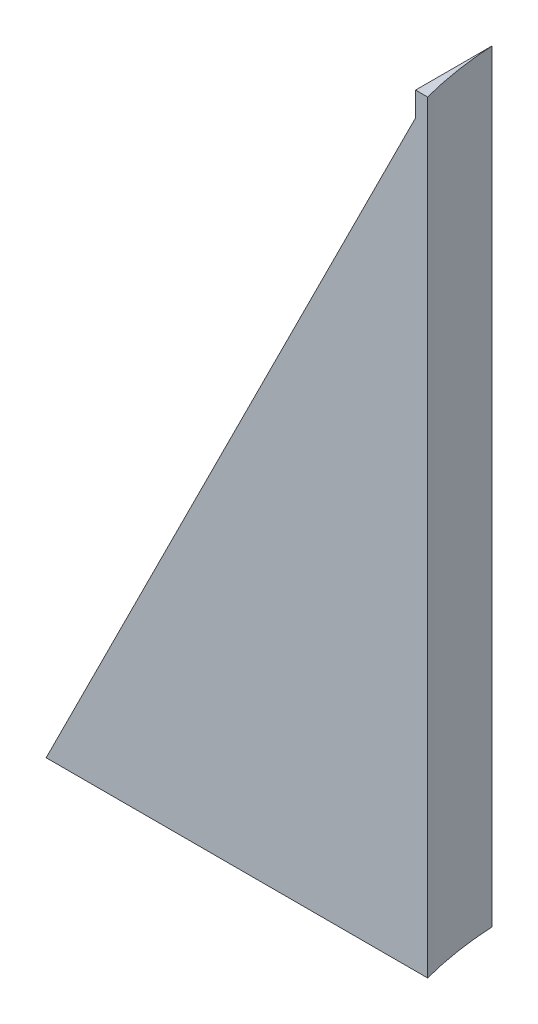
ISO-10303-21;
HEADER;
FILE_DESCRIPTION(('STEP AP214'),'2;1');
FILE_NAME('part.step','',(''),(''),'','','');
FILE_SCHEMA(('AUTOMOTIVE_DESIGN { 1 0 10303 214 1 1 1 1 }'));
ENDSEC;
DATA;
#1=APPLICATION_CONTEXT('core data for automotive mechanical design processes');
#2=APPLICATION_PROTOCOL_DEFINITION('international standard','automotive_design',2000,#1);
#3=PRODUCT_CONTEXT('',#1,'mechanical');
#4=PRODUCT('Part','Part','',(#3));
#5=PRODUCT_RELATED_PRODUCT_CATEGORY('part','',(#4));
#6=PRODUCT_DEFINITION_FORMATION('','',#4);
#7=PRODUCT_DEFINITION_CONTEXT('part definition',#1,'design');
#8=PRODUCT_DEFINITION('design','',#6,#7);
#9=PRODUCT_DEFINITION_SHAPE('','',#8);
#10=(LENGTH_UNIT() NAMED_UNIT(*) SI_UNIT(.MILLI.,.METRE.));
#11=(NAMED_UNIT(*) PLANE_ANGLE_UNIT() SI_UNIT($,.RADIAN.));
#12=(NAMED_UNIT(*) SI_UNIT($,.STERADIAN.) SOLID_ANGLE_UNIT());
#13=UNCERTAINTY_MEASURE_WITH_UNIT(LENGTH_MEASURE(1.E-05),#10,'distance_accuracy_value','');
#14=(GEOMETRIC_REPRESENTATION_CONTEXT(3) GLOBAL_UNCERTAINTY_ASSIGNED_CONTEXT((#13)) GLOBAL_UNIT_ASSIGNED_CONTEXT((#10,
#11,#12)) REPRESENTATION_CONTEXT('',''));
#15=CARTESIAN_POINT('',(0.,0.,0.));
#16=DIRECTION('',(0.,0.,1.));
#17=DIRECTION('',(1.,0.,0.));
#18=AXIS2_PLACEMENT_3D('',#15,#16,#17);
#19=CARTESIAN_POINT('',(0.,200.,5.53738654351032));
#20=DIRECTION('',(0.,0.,-1.));
#21=DIRECTION('',(-1.,0.,0.));
#22=AXIS2_PLACEMENT_3D('',#19,#20,#21);
#23=PLANE('',#22);
#24=DIRECTION('',(1.,0.,0.));
#25=VECTOR('',#24,1.);
#26=CARTESIAN_POINT('',(0.,0.,5.53738654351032));
#27=LINE('',#26,#25);
#28=CARTESIAN_POINT('',(-69.2200891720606,0.,5.53738654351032));
#29=VERTEX_POINT('',#28);
#30=CARTESIAN_POINT('',(27.6216456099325,0.,5.53738654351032));
#31=VERTEX_POINT('',#30);
#32=EDGE_CURVE('E81',#29,#31,#27,.T.);
#33=ORIENTED_EDGE('',*,*,#32,.F.);
#34=DIRECTION('',(0.447213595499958,0.894427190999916,0.));
#35=VECTOR('',#34,1.);
#36=CARTESIAN_POINT('',(24.6239286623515,187.688035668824,5.53738654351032));
#37=LINE('',#36,#35);
#38=CARTESIAN_POINT('',(27.6216456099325,193.683469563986,5.53738654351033));
#39=VERTEX_POINT('',#38);
#40=EDGE_CURVE('E65',#29,#39,#37,.T.);
#41=ORIENTED_EDGE('',*,*,#40,.T.);
#42=DIRECTION('',(0.,-1.,0.));
#43=VECTOR('',#42,1.);
#44=CARTESIAN_POINT('',(27.6216456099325,200.,5.53738654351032));
#45=LINE('',#44,#43);
#46=EDGE_CURVE('E82',#39,#31,#45,.T.);
#47=ORIENTED_EDGE('',*,*,#46,.T.);
#48=EDGE_LOOP('',(#33,#41,#47));
#49=FACE_BOUND('',#48,.T.);
#50=ADVANCED_FACE('F35',(#49),#23,.T.);
#51=CARTESIAN_POINT('',(0.,200.,25.5373865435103));
#52=DIRECTION('',(0.,0.,-1.));
#53=DIRECTION('',(-1.,0.,0.));
#54=AXIS2_PLACEMENT_3D('',#51,#52,#53);
#55=PLANE('',#54);
#56=DIRECTION('',(0.,-1.,0.));
#57=VECTOR('',#56,1.);
#58=CARTESIAN_POINT('',(27.6216456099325,0.,25.5373865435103));
#59=LINE('',#58,#57);
#60=CARTESIAN_POINT('',(27.6216456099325,200.,25.5373865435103));
#61=VERTEX_POINT('',#60);
#62=CARTESIAN_POINT('',(27.6216456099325,193.683469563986,25.5373865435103));
#63=VERTEX_POINT('',#62);
#64=EDGE_CURVE('E115',#61,#63,#59,.T.);
#65=ORIENTED_EDGE('',*,*,#64,.T.);
#66=DIRECTION('',(-0.447213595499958,-0.894427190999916,0.));
#67=VECTOR('',#66,1.);
#68=CARTESIAN_POINT('',(-55.3760713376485,27.6880356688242,25.5373865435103));
#69=LINE('',#68,#67);
#70=CARTESIAN_POINT('',(-69.2200891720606,0.,25.5373865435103));
#71=VERTEX_POINT('',#70);
#72=EDGE_CURVE('E114',#63,#71,#69,.T.);
#73=ORIENTED_EDGE('',*,*,#72,.T.);
#74=DIRECTION('',(1.,0.,0.));
#75=VECTOR('',#74,1.);
#76=CARTESIAN_POINT('',(0.,0.,25.5373865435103));
#77=LINE('',#76,#75);
#78=CARTESIAN_POINT('',(30.7799108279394,0.,25.5373865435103));
#79=VERTEX_POINT('',#78);
#80=EDGE_CURVE('E90',#71,#79,#77,.T.);
#81=ORIENTED_EDGE('',*,*,#80,.T.);
#82=DIRECTION('',(0.,-1.,0.));
#83=VECTOR('',#82,1.);
#84=CARTESIAN_POINT('',(30.7799108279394,200.,25.5373865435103));
#85=LINE('',#84,#83);
#86=CARTESIAN_POINT('',(30.7799108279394,200.,25.5373865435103));
#87=VERTEX_POINT('',#86);
#88=EDGE_CURVE('E96',#87,#79,#85,.T.);
#89=ORIENTED_EDGE('',*,*,#88,.F.);
#90=DIRECTION('',(1.,0.,0.));
#91=VECTOR('',#90,1.);
#92=CARTESIAN_POINT('',(0.,200.,25.5373865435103));
#93=LINE('',#92,#91);
#94=EDGE_CURVE('E50',#61,#87,#93,.T.);
#95=ORIENTED_EDGE('',*,*,#94,.F.);
#96=EDGE_LOOP('',(#65,#73,#81,#89,#95));
#97=FACE_BOUND('',#96,.T.);
#98=ADVANCED_FACE('F113',(#97),#55,.F.);
#99=CARTESIAN_POINT('',(0.,200.,0.));
#100=DIRECTION('',(0.,1.,0.));
#101=DIRECTION('',(0.,0.,1.));
#102=AXIS2_PLACEMENT_3D('',#99,#100,#101);
#103=PLANE('',#102);
#104=CARTESIAN_POINT('',(127.469293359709,200.,0.0194848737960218));
#105=DIRECTION('',(0.,1.,0.));
#106=DIRECTION('',(0.,0.,1.));
#107=AXIS2_PLACEMENT_3D('',#104,#105,#106);
#108=CIRCLE('',#107,100.);
#109=CARTESIAN_POINT('',(27.6216456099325,200.,5.53738654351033));
#110=VERTEX_POINT('',#109);
#111=EDGE_CURVE('E92',#110,#87,#108,.T.);
#112=ORIENTED_EDGE('',*,*,#111,.F.);
#113=DIRECTION('',(0.,0.,1.));
#114=VECTOR('',#113,1.);
#115=CARTESIAN_POINT('',(27.6216456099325,200.,0.));
#116=LINE('',#115,#114);
#117=EDGE_CURVE('E11',#110,#61,#116,.T.);
#118=ORIENTED_EDGE('',*,*,#117,.T.);
#119=ORIENTED_EDGE('',*,*,#94,.T.);
#120=EDGE_LOOP('',(#112,#118,#119));
#121=FACE_BOUND('',#120,.T.);
#122=ADVANCED_FACE('F106',(#121),#103,.T.);
#123=CARTESIAN_POINT('',(127.469293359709,200.,0.0194848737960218));
#124=DIRECTION('',(0.,-1.,0.));
#125=DIRECTION('',(0.,0.,-1.));
#126=AXIS2_PLACEMENT_3D('',#123,#124,#125);
#127=CYLINDRICAL_SURFACE('',#126,100.);
#128=CARTESIAN_POINT('',(127.469293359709,0.,0.0194848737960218));
#129=DIRECTION('',(0.,1.,0.));
#130=DIRECTION('',(0.,0.,1.));
#131=AXIS2_PLACEMENT_3D('',#128,#129,#130);
#132=CIRCLE('',#131,100.);
#133=EDGE_CURVE('E78',#31,#79,#132,.T.);
#134=ORIENTED_EDGE('',*,*,#133,.F.);
#135=ORIENTED_EDGE('',*,*,#46,.F.);
#136=EDGE_CURVE('E44',#110,#39,#45,.T.);
#137=ORIENTED_EDGE('',*,*,#136,.F.);
#138=ORIENTED_EDGE('',*,*,#111,.T.);
#139=ORIENTED_EDGE('',*,*,#88,.T.);
#140=EDGE_LOOP('',(#134,#135,#137,#138,#139));
#141=FACE_BOUND('',#140,.T.);
#142=ADVANCED_FACE('F37',(#141),#127,.F.);
#143=CARTESIAN_POINT('',(0.,0.,0.));
#144=DIRECTION('',(0.,1.,0.));
#145=DIRECTION('',(0.,0.,1.));
#146=AXIS2_PLACEMENT_3D('',#143,#144,#145);
#147=PLANE('',#146);
#148=ORIENTED_EDGE('',*,*,#133,.T.);
#149=ORIENTED_EDGE('',*,*,#80,.F.);
#150=DIRECTION('',(0.,0.,-1.));
#151=VECTOR('',#150,1.);
#152=CARTESIAN_POINT('',(-69.2200891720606,0.,0.));
#153=LINE('',#152,#151);
#154=EDGE_CURVE('E71',#71,#29,#153,.T.);
#155=ORIENTED_EDGE('',*,*,#154,.T.);
#156=ORIENTED_EDGE('',*,*,#32,.T.);
#157=EDGE_LOOP('',(#148,#149,#155,#156));
#158=FACE_BOUND('',#157,.T.);
#159=ADVANCED_FACE('F88',(#158),#147,.F.);
#160=CARTESIAN_POINT('',(27.6216456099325,0.,-174.46261345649));
#161=DIRECTION('',(-1.,0.,0.));
#162=DIRECTION('',(0.,-1.,0.));
#163=AXIS2_PLACEMENT_3D('',#160,#161,#162);
#164=PLANE('',#163);
#165=DIRECTION('',(0.,0.,1.));
#166=VECTOR('',#165,1.);
#167=CARTESIAN_POINT('',(27.6216456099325,193.683469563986,-174.46261345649));
#168=LINE('',#167,#166);
#169=EDGE_CURVE('E75',#39,#63,#168,.T.);
#170=ORIENTED_EDGE('',*,*,#169,.T.);
#171=ORIENTED_EDGE('',*,*,#64,.F.);
#172=ORIENTED_EDGE('',*,*,#117,.F.);
#173=ORIENTED_EDGE('',*,*,#136,.T.);
#174=EDGE_LOOP('',(#170,#171,#172,#173));
#175=FACE_BOUND('',#174,.T.);
#176=ADVANCED_FACE('F101',(#175),#164,.T.);
#177=CARTESIAN_POINT('',(-55.3760713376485,27.6880356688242,-174.46261345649));
#178=DIRECTION('',(-0.894427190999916,0.447213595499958,0.));
#179=DIRECTION('',(-0.447213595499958,-0.894427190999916,0.));
#180=AXIS2_PLACEMENT_3D('',#177,#178,#179);
#181=PLANE('',#180);
#182=ORIENTED_EDGE('',*,*,#154,.F.);
#183=ORIENTED_EDGE('',*,*,#72,.F.);
#184=ORIENTED_EDGE('',*,*,#169,.F.);
#185=ORIENTED_EDGE('',*,*,#40,.F.);
#186=EDGE_LOOP('',(#182,#183,#184,#185));
#187=FACE_BOUND('',#186,.T.);
#188=ADVANCED_FACE('F67',(#187),#181,.T.);
#189=CLOSED_SHELL('',(#50,#98,#122,#142,#159,#176,#188));
#190=MANIFOLD_SOLID_BREP('B2',#189);
#191=ADVANCED_BREP_SHAPE_REPRESENTATION('',(#18,#190),#14);
#192=SHAPE_DEFINITION_REPRESENTATION(#9,#191);
ENDSEC;
END-ISO-10303-21;
